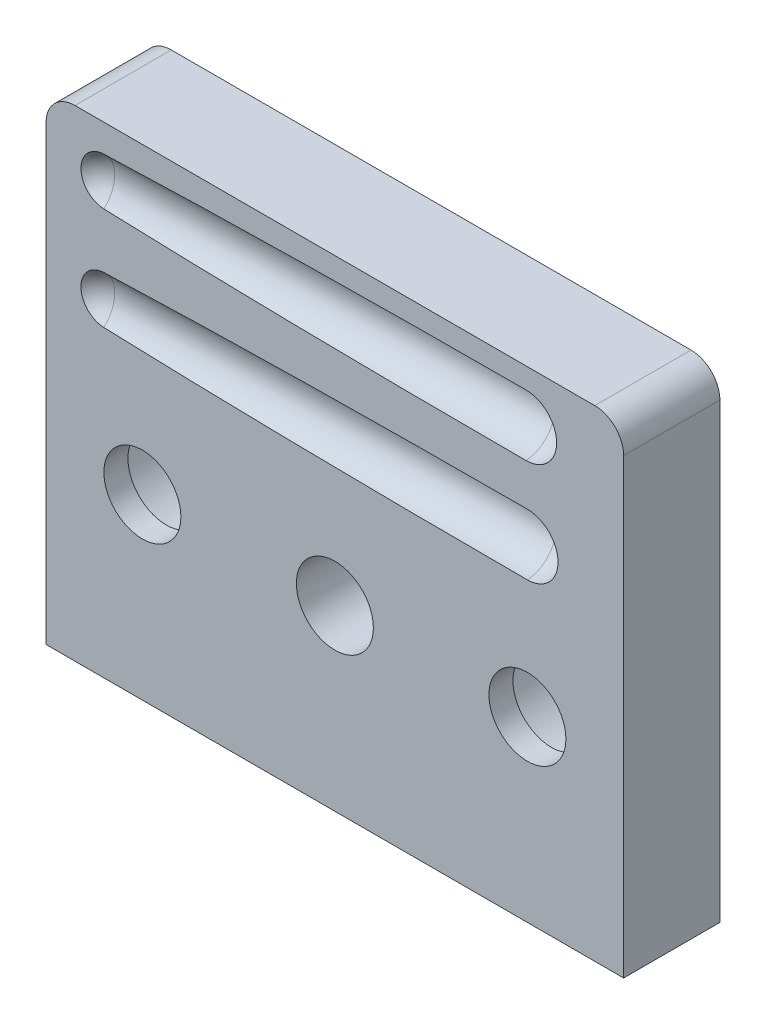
from build123d import *

# Parameters (mm, degrees)
ESQUISSE1_W             = 60
ESQUISSE1_H             = 50
BASE_EXTRUSION_DEPTH    = 10
CONG_1_R                = 3
ESQUISSE2_R             = 4
ENL_V_MAT_EXTRU_1_DEPTH = 10
ESQUISSE8_R             = 6.75
ENL_V_MAT_EXTRU_2_DEPTH = 7.5
ESQUISSE9_R             = 6.75
ENL_V_MAT_EXTRU_3_DEPTH = 4


with BuildPart() as part:
    # Esquisse1 → Base-Extrusion (new body)
    with BuildSketch(Plane.XY):
        with Locations((0, 6.5)):
            Rectangle(ESQUISSE1_W, ESQUISSE1_H)
    extrude(amount=BASE_EXTRUSION_DEPTH)

    # Cong_1
    cong_1_edges = [part.edges().sort_by_distance(p)[0] for p in [
        (30, 31.5, 5),
        (-30, 31.5, 5),
    ]]
    fillet(cong_1_edges, radius=CONG_1_R)

    # Esquisse2 → Enl_v. mat.-Extru.1 (cut)
    with BuildSketch(Plane.XY.offset(10)):
        with Locations((-20, 0)):
            Circle(ESQUISSE2_R)
        Circle(ESQUISSE2_R)
        with Locations((20, 0)):
            Circle(ESQUISSE2_R)
    extrude(amount=-ENL_V_MAT_EXTRU_1_DEPTH, mode=Mode.SUBTRACT)

    # Esquisse6 → Enlever de la mati_re-R_volution1 (revolve, cut)
    with BuildSketch(Plane(origin=(0.494318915, 0, 10.885747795), x_dir=(0.9989705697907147, 0, -0.045362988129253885), z_dir=(0.045362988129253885, 0, 0.9989705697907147))):
        with BuildLine():
            Line((-24.428923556, 29.335740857), (19.387068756, 29.335740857))
            ThreePointArc((19.387068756, 29.335740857), (21.632132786, 28.405804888), (22.562068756, 26.160740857))
            Line((22.562068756, 26.160740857), (-27.603923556, 26.160740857))
            ThreePointArc((-27.603923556, 26.160740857), (-26.673987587, 28.405804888), (-24.428923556, 29.335740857))
        make_face()
    revolve(axis=Axis((-32.471709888, 26.160740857, 12.382726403), (0.9989705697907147, 0, -0.04536298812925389)), mode=Mode.SUBTRACT)

    # Esquisse7 → Enlever de la mati_re-R_volution2 (revolve, cut)
    with BuildSketch(Plane(origin=(0.494318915, 0, 10.885747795), x_dir=(0.9989705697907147, 0, -0.045362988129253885), z_dir=(0.045362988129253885, 0, 0.9989705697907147))):
        with BuildLine():
            Line((-24.428923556, 12.32), (19.525781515, 12.32))
            ThreePointArc((19.525781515, 12.32), (21.774381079, 13.251400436), (22.705781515, 15.5))
            Line((22.705781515, 15.5), (-27.608923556, 15.5))
            ThreePointArc((-27.608923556, 15.5), (-26.67752312, 13.251400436), (-24.428923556, 12.32))
        make_face()
    revolve(axis=Axis((-33.470680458, 15.5, 12.428089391), (0.9989705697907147, 0, -0.0453629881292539)), mode=Mode.SUBTRACT)

    # Esquisse8 → Enl_v. mat.-Extru.2 (cut)
    with BuildSketch(Plane(origin=(0, 0, 0), x_dir=(-1, 0, 0), z_dir=(0, 0, -1))):
        with Locations((-20, 0)):
            Circle(ESQUISSE8_R)
        with Locations((20, 0)):
            Circle(ESQUISSE8_R)
    extrude(amount=-ENL_V_MAT_EXTRU_2_DEPTH, mode=Mode.SUBTRACT)

    # Esquisse9 → Enl_v. mat.-Extru.3 (cut)
    with BuildSketch(Plane(origin=(0, 0, 0), x_dir=(-1, 0, 0), z_dir=(0, 0, -1))):
        Circle(ESQUISSE9_R)
    extrude(amount=-ENL_V_MAT_EXTRU_3_DEPTH, mode=Mode.SUBTRACT)


solid = part.part
